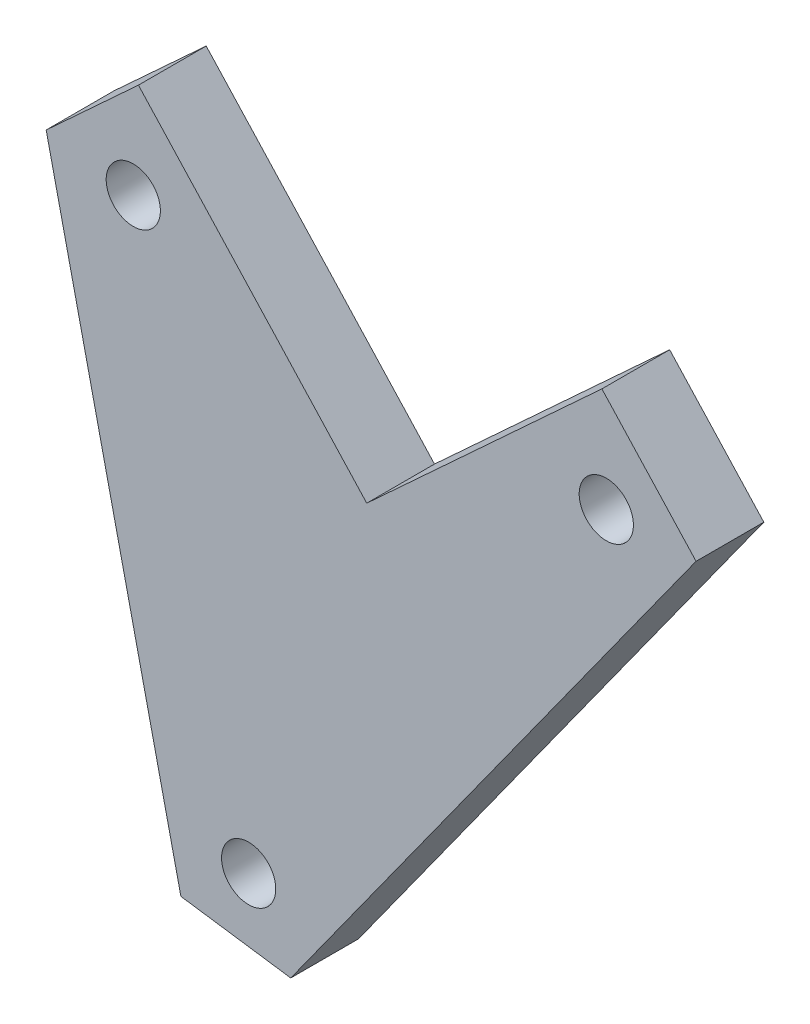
from build123d import *

# Parameters (mm, degrees)
SKETCH1_R           = 2.54
BOSS_EXTRUDE1_DEPTH = 6.35


with BuildPart() as part:
    # Sketch1 → Boss-Extrude1 (new body)
    with BuildSketch(Plane.XY):
        Polygon((3.942697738, -6.515954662), (41.925429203, 46.291623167), (33.102078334, 55.872520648), (11.06530678, 35.578162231), (-10.327430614, 58.807616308), (-18.972966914, 50.845669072), (-6.349614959, -5.040467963), align=None)
        with Locations((-10.809665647, 49.636590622)):
            Circle(SKETCH1_R, mode=Mode.SUBTRACT)
        with Locations((33.514297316, 46.291623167)):
            Circle(SKETCH1_R, mode=Mode.SUBTRACT)
        Circle(SKETCH1_R, mode=Mode.SUBTRACT)
    extrude(amount=BOSS_EXTRUDE1_DEPTH)


solid = part.part
